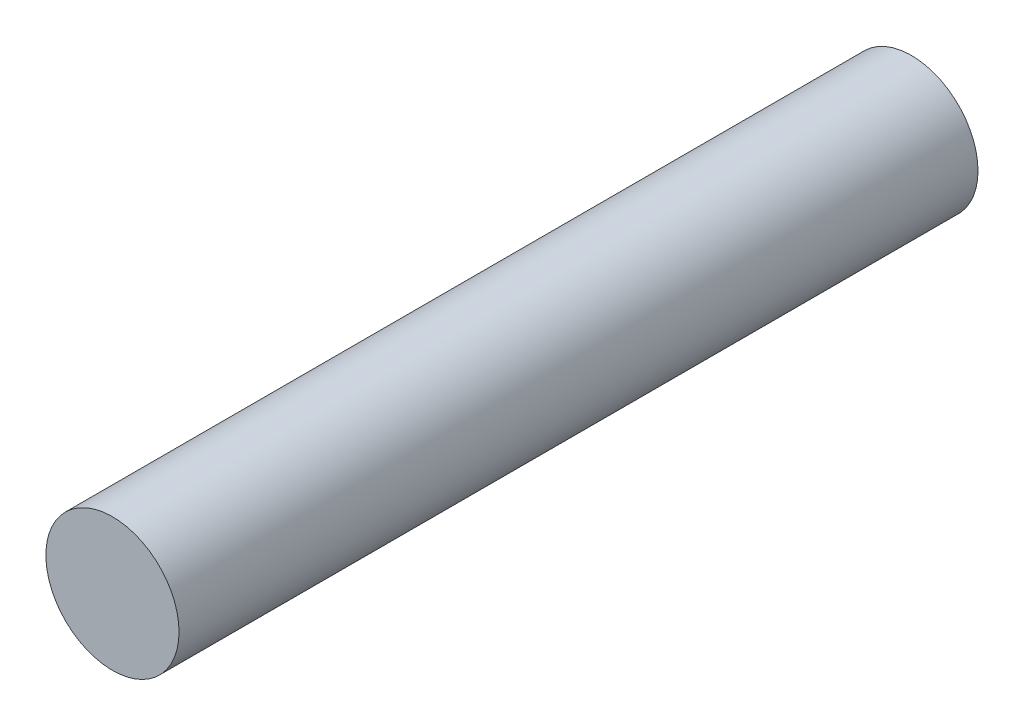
ISO-10303-21;
HEADER;
FILE_DESCRIPTION(('STEP AP214'),'2;1');
FILE_NAME('part.step','',(''),(''),'','','');
FILE_SCHEMA(('AUTOMOTIVE_DESIGN { 1 0 10303 214 1 1 1 1 }'));
ENDSEC;
DATA;
#1=APPLICATION_CONTEXT('core data for automotive mechanical design processes');
#2=APPLICATION_PROTOCOL_DEFINITION('international standard','automotive_design',2000,#1);
#3=PRODUCT_CONTEXT('',#1,'mechanical');
#4=PRODUCT('Part','Part','',(#3));
#5=PRODUCT_RELATED_PRODUCT_CATEGORY('part','',(#4));
#6=PRODUCT_DEFINITION_FORMATION('','',#4);
#7=PRODUCT_DEFINITION_CONTEXT('part definition',#1,'design');
#8=PRODUCT_DEFINITION('design','',#6,#7);
#9=PRODUCT_DEFINITION_SHAPE('','',#8);
#10=(LENGTH_UNIT() NAMED_UNIT(*) SI_UNIT(.MILLI.,.METRE.));
#11=(NAMED_UNIT(*) PLANE_ANGLE_UNIT() SI_UNIT($,.RADIAN.));
#12=(NAMED_UNIT(*) SI_UNIT($,.STERADIAN.) SOLID_ANGLE_UNIT());
#13=UNCERTAINTY_MEASURE_WITH_UNIT(LENGTH_MEASURE(1.E-05),#10,'distance_accuracy_value','');
#14=(GEOMETRIC_REPRESENTATION_CONTEXT(3) GLOBAL_UNCERTAINTY_ASSIGNED_CONTEXT((#13)) GLOBAL_UNIT_ASSIGNED_CONTEXT((#10,
#11,#12)) REPRESENTATION_CONTEXT('',''));
#15=CARTESIAN_POINT('',(0.,0.,0.));
#16=DIRECTION('',(0.,0.,1.));
#17=DIRECTION('',(1.,0.,0.));
#18=AXIS2_PLACEMENT_3D('',#15,#16,#17);
#19=CARTESIAN_POINT('',(0.,0.,-609.6));
#20=DIRECTION('',(0.,0.,1.));
#21=DIRECTION('',(1.,0.,0.));
#22=AXIS2_PLACEMENT_3D('',#19,#20,#21);
#23=CYLINDRICAL_SURFACE('',#22,50.8);
#24=CARTESIAN_POINT('',(0.,0.,-609.6));
#25=DIRECTION('',(0.,0.,1.));
#26=DIRECTION('',(1.,0.,0.));
#27=AXIS2_PLACEMENT_3D('',#24,#25,#26);
#28=CIRCLE('',#27,50.8);
#29=CARTESIAN_POINT('',(50.8,0.,-609.6));
#30=VERTEX_POINT('',#29);
#31=EDGE_CURVE('E10',#30,#30,#28,.T.);
#32=CARTESIAN_POINT('',(0.,0.,0.));
#33=DIRECTION('',(0.,0.,1.));
#34=DIRECTION('',(1.,0.,0.));
#35=AXIS2_PLACEMENT_3D('',#32,#33,#34);
#36=CIRCLE('',#35,50.8);
#37=CARTESIAN_POINT('',(50.8,0.,0.));
#38=VERTEX_POINT('',#37);
#39=EDGE_CURVE('E352',#38,#38,#36,.T.);
#40=CARTESIAN_POINT('',(50.8,0.,-609.6));
#41=CARTESIAN_POINT('',(50.8,0.,-603.25));
#42=CARTESIAN_POINT('',(50.8,0.,-596.9));
#43=CARTESIAN_POINT('',(50.8,0.,-584.2));
#44=CARTESIAN_POINT('',(50.8,0.,-577.85));
#45=CARTESIAN_POINT('',(50.8,0.,-565.15));
#46=CARTESIAN_POINT('',(50.8,0.,-558.8));
#47=CARTESIAN_POINT('',(50.8,0.,-546.1));
#48=CARTESIAN_POINT('',(50.8,0.,-539.75));
#49=CARTESIAN_POINT('',(50.8,0.,-527.05));
#50=CARTESIAN_POINT('',(50.8,0.,-520.7));
#51=CARTESIAN_POINT('',(50.8,0.,-508.));
#52=CARTESIAN_POINT('',(50.8,0.,-501.65));
#53=CARTESIAN_POINT('',(50.8,0.,-488.95));
#54=CARTESIAN_POINT('',(50.8,0.,-482.6));
#55=CARTESIAN_POINT('',(50.8,0.,-469.9));
#56=CARTESIAN_POINT('',(50.8,0.,-463.55));
#57=CARTESIAN_POINT('',(50.8,0.,-450.85));
#58=CARTESIAN_POINT('',(50.8,0.,-444.5));
#59=CARTESIAN_POINT('',(50.8,0.,-431.8));
#60=CARTESIAN_POINT('',(50.8,0.,-425.45));
#61=CARTESIAN_POINT('',(50.8,0.,-412.75));
#62=CARTESIAN_POINT('',(50.8,0.,-406.4));
#63=CARTESIAN_POINT('',(50.8,0.,-393.7));
#64=CARTESIAN_POINT('',(50.8,0.,-387.35));
#65=CARTESIAN_POINT('',(50.8,0.,-374.65));
#66=CARTESIAN_POINT('',(50.8,0.,-368.3));
#67=CARTESIAN_POINT('',(50.8,0.,-355.6));
#68=CARTESIAN_POINT('',(50.8,0.,-349.25));
#69=CARTESIAN_POINT('',(50.8,0.,-336.55));
#70=CARTESIAN_POINT('',(50.8,0.,-330.2));
#71=CARTESIAN_POINT('',(50.8,0.,-317.5));
#72=CARTESIAN_POINT('',(50.8,0.,-311.15));
#73=CARTESIAN_POINT('',(50.8,0.,-298.45));
#74=CARTESIAN_POINT('',(50.8,0.,-292.1));
#75=CARTESIAN_POINT('',(50.8,0.,-279.4));
#76=CARTESIAN_POINT('',(50.8,0.,-273.05));
#77=CARTESIAN_POINT('',(50.8,0.,-260.35));
#78=CARTESIAN_POINT('',(50.8,0.,-254.));
#79=CARTESIAN_POINT('',(50.8,0.,-241.3));
#80=CARTESIAN_POINT('',(50.8,0.,-234.95));
#81=CARTESIAN_POINT('',(50.8,0.,-222.25));
#82=CARTESIAN_POINT('',(50.8,0.,-215.9));
#83=CARTESIAN_POINT('',(50.8,0.,-203.2));
#84=CARTESIAN_POINT('',(50.8,0.,-196.85));
#85=CARTESIAN_POINT('',(50.8,0.,-184.15));
#86=CARTESIAN_POINT('',(50.8,0.,-177.8));
#87=CARTESIAN_POINT('',(50.8,0.,-165.1));
#88=CARTESIAN_POINT('',(50.8,0.,-158.75));
#89=CARTESIAN_POINT('',(50.8,0.,-146.05));
#90=CARTESIAN_POINT('',(50.8,0.,-139.7));
#91=CARTESIAN_POINT('',(50.8,0.,-127.));
#92=CARTESIAN_POINT('',(50.8,0.,-120.65));
#93=CARTESIAN_POINT('',(50.8,0.,-107.95));
#94=CARTESIAN_POINT('',(50.8,0.,-101.6));
#95=CARTESIAN_POINT('',(50.8,0.,-88.9));
#96=CARTESIAN_POINT('',(50.8,0.,-82.5500000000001));
#97=CARTESIAN_POINT('',(50.8,0.,-69.85));
#98=CARTESIAN_POINT('',(50.8,0.,-63.5));
#99=CARTESIAN_POINT('',(50.8,0.,-50.8));
#100=CARTESIAN_POINT('',(50.8,0.,-44.45));
#101=CARTESIAN_POINT('',(50.8,0.,-31.75));
#102=CARTESIAN_POINT('',(50.8,0.,-25.4));
#103=CARTESIAN_POINT('',(50.8,0.,-12.7));
#104=CARTESIAN_POINT('',(50.8,0.,-6.35000000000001));
#105=CARTESIAN_POINT('',(50.8,0.,0.));
#106=B_SPLINE_CURVE_WITH_KNOTS('',3,(#40,#41,#42,#43,#44,#45,#46,#47,#48,#49,#50,#51,#52,#53,
#54,#55,#56,#57,#58,#59,#60,#61,#62,#63,#64,#65,#66,#67,#68,#69,#70,#71,#72,#73,#74,#75,#76,#77,
#78,#79,#80,#81,#82,#83,#84,#85,#86,#87,#88,#89,#90,#91,#92,#93,#94,#95,#96,#97,#98,#99,#100,
#101,#102,#103,#104,#105),.UNSPECIFIED.,.F.,.F.,(4,2,2,2,2,2,2,2,2,2,2,2,2,2,2,2,2,2,2,2,2,2,2,
2,2,2,2,2,2,2,2,2,4),(0.,19.05,38.1,57.15,76.2,95.2500000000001,114.3,133.35,152.4,171.45,190.5,
209.55,228.6,247.65,266.7,285.75,304.8,323.85,342.9,361.95,381.,400.05,419.1,438.15,457.2,
476.25,495.3,514.35,533.4,552.45,571.5,590.55,609.6),.UNSPECIFIED.);
#107=EDGE_CURVE('BSEAM346',#30,#38,#106,.T.);
#108=ORIENTED_EDGE('',*,*,#31,.T.);
#109=ORIENTED_EDGE('',*,*,#39,.F.);
#110=ORIENTED_EDGE('',*,*,#107,.T.);
#111=ORIENTED_EDGE('',*,*,#107,.F.);
#112=EDGE_LOOP('',(#108,#110,#109,#111));
#113=FACE_BOUND('',#112,.T.);
#114=ADVANCED_FACE('F346',(#113),#23,.T.);
#115=CARTESIAN_POINT('',(0.,0.,-609.6));
#116=DIRECTION('',(0.,0.,1.));
#117=DIRECTION('',(1.,0.,0.));
#118=AXIS2_PLACEMENT_3D('',#115,#116,#117);
#119=PLANE('',#118);
#120=ORIENTED_EDGE('',*,*,#31,.F.);
#121=EDGE_LOOP('',(#120));
#122=FACE_BOUND('',#121,.T.);
#123=ADVANCED_FACE('F361',(#122),#119,.F.);
#124=CARTESIAN_POINT('',(0.,0.,0.));
#125=DIRECTION('',(0.,0.,1.));
#126=DIRECTION('',(1.,0.,0.));
#127=AXIS2_PLACEMENT_3D('',#124,#125,#126);
#128=PLANE('',#127);
#129=ORIENTED_EDGE('',*,*,#39,.T.);
#130=EDGE_LOOP('',(#129));
#131=FACE_BOUND('',#130,.T.);
#132=ADVANCED_FACE('F358',(#131),#128,.T.);
#133=CLOSED_SHELL('',(#114,#123,#132));
#134=MANIFOLD_SOLID_BREP('B2',#133);
#135=ADVANCED_BREP_SHAPE_REPRESENTATION('',(#18,#134),#14);
#136=SHAPE_DEFINITION_REPRESENTATION(#9,#135);
ENDSEC;
END-ISO-10303-21;
